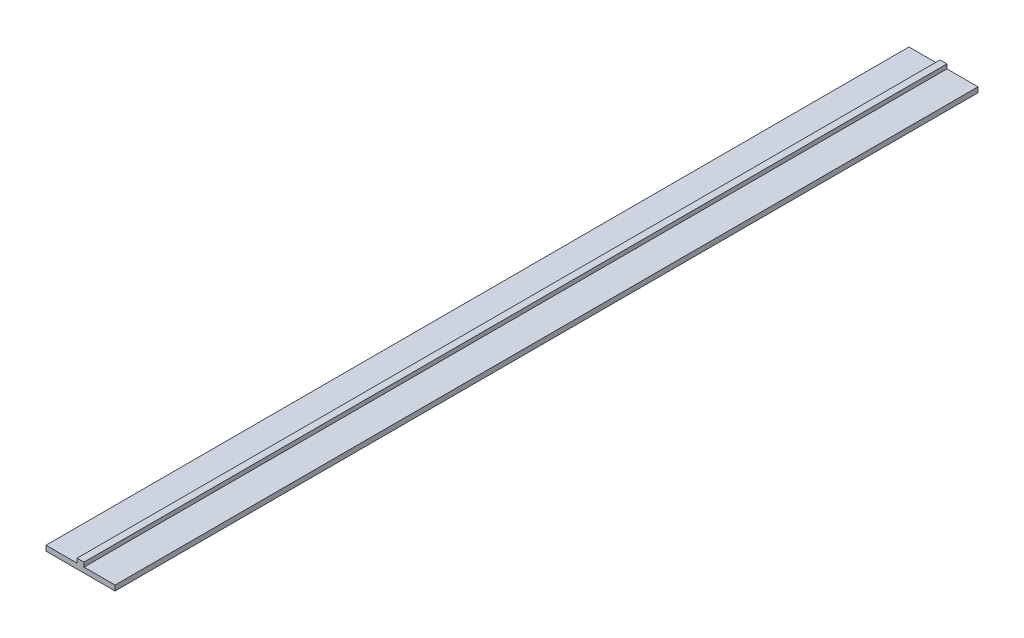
ISO-10303-21;
HEADER;
FILE_DESCRIPTION(('STEP AP214'),'2;1');
FILE_NAME('part.step','',(''),(''),'','','');
FILE_SCHEMA(('AUTOMOTIVE_DESIGN { 1 0 10303 214 1 1 1 1 }'));
ENDSEC;
DATA;
#1=APPLICATION_CONTEXT('core data for automotive mechanical design processes');
#2=APPLICATION_PROTOCOL_DEFINITION('international standard','automotive_design',2000,#1);
#3=PRODUCT_CONTEXT('',#1,'mechanical');
#4=PRODUCT('Part','Part','',(#3));
#5=PRODUCT_RELATED_PRODUCT_CATEGORY('part','',(#4));
#6=PRODUCT_DEFINITION_FORMATION('','',#4);
#7=PRODUCT_DEFINITION_CONTEXT('part definition',#1,'design');
#8=PRODUCT_DEFINITION('design','',#6,#7);
#9=PRODUCT_DEFINITION_SHAPE('','',#8);
#10=(LENGTH_UNIT() NAMED_UNIT(*) SI_UNIT(.MILLI.,.METRE.));
#11=(NAMED_UNIT(*) PLANE_ANGLE_UNIT() SI_UNIT($,.RADIAN.));
#12=(NAMED_UNIT(*) SI_UNIT($,.STERADIAN.) SOLID_ANGLE_UNIT());
#13=UNCERTAINTY_MEASURE_WITH_UNIT(LENGTH_MEASURE(1.E-05),#10,'distance_accuracy_value','');
#14=(GEOMETRIC_REPRESENTATION_CONTEXT(3) GLOBAL_UNCERTAINTY_ASSIGNED_CONTEXT((#13)) GLOBAL_UNIT_ASSIGNED_CONTEXT((#10,
#11,#12)) REPRESENTATION_CONTEXT('',''));
#15=CARTESIAN_POINT('',(0.,0.,0.));
#16=DIRECTION('',(0.,0.,1.));
#17=DIRECTION('',(1.,0.,0.));
#18=AXIS2_PLACEMENT_3D('',#15,#16,#17);
#19=CARTESIAN_POINT('',(-20.,3.,500.));
#20=DIRECTION('',(1.,0.,0.));
#21=DIRECTION('',(0.,0.,-1.));
#22=AXIS2_PLACEMENT_3D('',#19,#20,#21);
#23=PLANE('',#22);
#24=DIRECTION('',(0.,-1.,0.));
#25=VECTOR('',#24,1.);
#26=CARTESIAN_POINT('',(-20.,3.,0.));
#27=LINE('',#26,#25);
#28=CARTESIAN_POINT('',(-20.,3.,0.));
#29=VERTEX_POINT('',#28);
#30=CARTESIAN_POINT('',(-20.,0.,0.));
#31=VERTEX_POINT('',#30);
#32=EDGE_CURVE('E110',#29,#31,#27,.T.);
#33=ORIENTED_EDGE('',*,*,#32,.T.);
#34=DIRECTION('',(0.,0.,-1.));
#35=VECTOR('',#34,1.);
#36=CARTESIAN_POINT('',(-20.,0.,500.));
#37=LINE('',#36,#35);
#38=CARTESIAN_POINT('',(-20.,0.,500.));
#39=VERTEX_POINT('',#38);
#40=EDGE_CURVE('E9',#39,#31,#37,.T.);
#41=ORIENTED_EDGE('',*,*,#40,.F.);
#42=DIRECTION('',(0.,-1.,0.));
#43=VECTOR('',#42,1.);
#44=CARTESIAN_POINT('',(-20.,3.,500.));
#45=LINE('',#44,#43);
#46=CARTESIAN_POINT('',(-20.,3.,500.));
#47=VERTEX_POINT('',#46);
#48=EDGE_CURVE('E124',#47,#39,#45,.T.);
#49=ORIENTED_EDGE('',*,*,#48,.F.);
#50=DIRECTION('',(0.,0.,-1.));
#51=VECTOR('',#50,1.);
#52=CARTESIAN_POINT('',(-20.,3.,500.));
#53=LINE('',#52,#51);
#54=EDGE_CURVE('E106',#47,#29,#53,.T.);
#55=ORIENTED_EDGE('',*,*,#54,.T.);
#56=EDGE_LOOP('',(#33,#41,#49,#55));
#57=FACE_BOUND('',#56,.T.);
#58=ADVANCED_FACE('F14',(#57),#23,.F.);
#59=CARTESIAN_POINT('',(-20.,0.,500.));
#60=DIRECTION('',(0.,1.,0.));
#61=DIRECTION('',(0.,0.,1.));
#62=AXIS2_PLACEMENT_3D('',#59,#60,#61);
#63=PLANE('',#62);
#64=DIRECTION('',(1.,0.,0.));
#65=VECTOR('',#64,1.);
#66=CARTESIAN_POINT('',(-20.,0.,0.));
#67=LINE('',#66,#65);
#68=CARTESIAN_POINT('',(20.,0.,0.));
#69=VERTEX_POINT('',#68);
#70=EDGE_CURVE('E113',#31,#69,#67,.T.);
#71=ORIENTED_EDGE('',*,*,#70,.T.);
#72=DIRECTION('',(0.,0.,-1.));
#73=VECTOR('',#72,1.);
#74=CARTESIAN_POINT('',(20.,0.,500.));
#75=LINE('',#74,#73);
#76=CARTESIAN_POINT('',(20.,0.,500.));
#77=VERTEX_POINT('',#76);
#78=EDGE_CURVE('E22',#77,#69,#75,.T.);
#79=ORIENTED_EDGE('',*,*,#78,.F.);
#80=DIRECTION('',(1.,0.,0.));
#81=VECTOR('',#80,1.);
#82=CARTESIAN_POINT('',(-20.,0.,500.));
#83=LINE('',#82,#81);
#84=EDGE_CURVE('E73',#39,#77,#83,.T.);
#85=ORIENTED_EDGE('',*,*,#84,.F.);
#86=ORIENTED_EDGE('',*,*,#40,.T.);
#87=EDGE_LOOP('',(#71,#79,#85,#86));
#88=FACE_BOUND('',#87,.T.);
#89=ADVANCED_FACE('F159',(#88),#63,.F.);
#90=CARTESIAN_POINT('',(20.,3.,500.));
#91=DIRECTION('',(-1.,0.,0.));
#92=DIRECTION('',(0.,0.,1.));
#93=AXIS2_PLACEMENT_3D('',#90,#91,#92);
#94=PLANE('',#93);
#95=DIRECTION('',(0.,1.,0.));
#96=VECTOR('',#95,1.);
#97=CARTESIAN_POINT('',(20.,3.,0.));
#98=LINE('',#97,#96);
#99=CARTESIAN_POINT('',(20.,3.,0.));
#100=VERTEX_POINT('',#99);
#101=EDGE_CURVE('E115',#69,#100,#98,.T.);
#102=ORIENTED_EDGE('',*,*,#101,.T.);
#103=DIRECTION('',(0.,0.,-1.));
#104=VECTOR('',#103,1.);
#105=CARTESIAN_POINT('',(20.,3.,500.));
#106=LINE('',#105,#104);
#107=CARTESIAN_POINT('',(20.,3.,500.));
#108=VERTEX_POINT('',#107);
#109=EDGE_CURVE('E131',#108,#100,#106,.T.);
#110=ORIENTED_EDGE('',*,*,#109,.F.);
#111=DIRECTION('',(0.,1.,0.));
#112=VECTOR('',#111,1.);
#113=CARTESIAN_POINT('',(20.,3.,500.));
#114=LINE('',#113,#112);
#115=EDGE_CURVE('E139',#77,#108,#114,.T.);
#116=ORIENTED_EDGE('',*,*,#115,.F.);
#117=ORIENTED_EDGE('',*,*,#78,.T.);
#118=EDGE_LOOP('',(#102,#110,#116,#117));
#119=FACE_BOUND('',#118,.T.);
#120=ADVANCED_FACE('F137',(#119),#94,.F.);
#121=CARTESIAN_POINT('',(20.,3.,500.));
#122=DIRECTION('',(0.,-1.,0.));
#123=DIRECTION('',(0.,0.,-1.));
#124=AXIS2_PLACEMENT_3D('',#121,#122,#123);
#125=PLANE('',#124);
#126=DIRECTION('',(-1.,0.,0.));
#127=VECTOR('',#126,1.);
#128=CARTESIAN_POINT('',(20.,3.,0.));
#129=LINE('',#128,#127);
#130=CARTESIAN_POINT('',(2.00000000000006,3.,0.));
#131=VERTEX_POINT('',#130);
#132=EDGE_CURVE('E117',#100,#131,#129,.T.);
#133=ORIENTED_EDGE('',*,*,#132,.T.);
#134=DIRECTION('',(0.,0.,-1.));
#135=VECTOR('',#134,1.);
#136=CARTESIAN_POINT('',(2.00000000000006,3.,500.));
#137=LINE('',#136,#135);
#138=CARTESIAN_POINT('',(2.00000000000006,3.,500.));
#139=VERTEX_POINT('',#138);
#140=EDGE_CURVE('E128',#139,#131,#137,.T.);
#141=ORIENTED_EDGE('',*,*,#140,.F.);
#142=DIRECTION('',(-1.,0.,0.));
#143=VECTOR('',#142,1.);
#144=CARTESIAN_POINT('',(20.,3.,500.));
#145=LINE('',#144,#143);
#146=EDGE_CURVE('E151',#108,#139,#145,.T.);
#147=ORIENTED_EDGE('',*,*,#146,.F.);
#148=ORIENTED_EDGE('',*,*,#109,.T.);
#149=EDGE_LOOP('',(#133,#141,#147,#148));
#150=FACE_BOUND('',#149,.T.);
#151=ADVANCED_FACE('F147',(#150),#125,.F.);
#152=CARTESIAN_POINT('',(2.00000000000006,5.5,500.));
#153=DIRECTION('',(-1.,0.,0.));
#154=DIRECTION('',(0.,0.,1.));
#155=AXIS2_PLACEMENT_3D('',#152,#153,#154);
#156=PLANE('',#155);
#157=DIRECTION('',(0.,1.,0.));
#158=VECTOR('',#157,1.);
#159=CARTESIAN_POINT('',(2.00000000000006,5.5,0.));
#160=LINE('',#159,#158);
#161=CARTESIAN_POINT('',(2.00000000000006,5.5,0.));
#162=VERTEX_POINT('',#161);
#163=EDGE_CURVE('E119',#131,#162,#160,.T.);
#164=ORIENTED_EDGE('',*,*,#163,.T.);
#165=DIRECTION('',(0.,0.,-1.));
#166=VECTOR('',#165,1.);
#167=CARTESIAN_POINT('',(2.00000000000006,5.5,500.));
#168=LINE('',#167,#166);
#169=CARTESIAN_POINT('',(2.00000000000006,5.5,500.));
#170=VERTEX_POINT('',#169);
#171=EDGE_CURVE('E101',#170,#162,#168,.T.);
#172=ORIENTED_EDGE('',*,*,#171,.F.);
#173=DIRECTION('',(0.,1.,0.));
#174=VECTOR('',#173,1.);
#175=CARTESIAN_POINT('',(2.00000000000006,5.5,500.));
#176=LINE('',#175,#174);
#177=EDGE_CURVE('E92',#139,#170,#176,.T.);
#178=ORIENTED_EDGE('',*,*,#177,.F.);
#179=ORIENTED_EDGE('',*,*,#140,.T.);
#180=EDGE_LOOP('',(#164,#172,#178,#179));
#181=FACE_BOUND('',#180,.T.);
#182=ADVANCED_FACE('F150',(#181),#156,.F.);
#183=CARTESIAN_POINT('',(-2.00000000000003,5.5,500.));
#184=DIRECTION('',(0.,-1.,0.));
#185=DIRECTION('',(0.,0.,-1.));
#186=AXIS2_PLACEMENT_3D('',#183,#184,#185);
#187=PLANE('',#186);
#188=DIRECTION('',(-1.,0.,0.));
#189=VECTOR('',#188,1.);
#190=CARTESIAN_POINT('',(-2.00000000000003,5.5,0.));
#191=LINE('',#190,#189);
#192=CARTESIAN_POINT('',(-2.00000000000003,5.5,0.));
#193=VERTEX_POINT('',#192);
#194=EDGE_CURVE('E100',#162,#193,#191,.T.);
#195=ORIENTED_EDGE('',*,*,#194,.T.);
#196=DIRECTION('',(0.,0.,-1.));
#197=VECTOR('',#196,1.);
#198=CARTESIAN_POINT('',(-2.00000000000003,5.5,500.));
#199=LINE('',#198,#197);
#200=CARTESIAN_POINT('',(-2.00000000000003,5.5,500.));
#201=VERTEX_POINT('',#200);
#202=EDGE_CURVE('E97',#201,#193,#199,.T.);
#203=ORIENTED_EDGE('',*,*,#202,.F.);
#204=DIRECTION('',(-1.,0.,0.));
#205=VECTOR('',#204,1.);
#206=CARTESIAN_POINT('',(-2.00000000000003,5.5,500.));
#207=LINE('',#206,#205);
#208=EDGE_CURVE('E86',#170,#201,#207,.T.);
#209=ORIENTED_EDGE('',*,*,#208,.F.);
#210=ORIENTED_EDGE('',*,*,#171,.T.);
#211=EDGE_LOOP('',(#195,#203,#209,#210));
#212=FACE_BOUND('',#211,.T.);
#213=ADVANCED_FACE('F98',(#212),#187,.F.);
#214=CARTESIAN_POINT('',(-2.00000000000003,5.5,500.));
#215=DIRECTION('',(1.,0.,0.));
#216=DIRECTION('',(0.,0.,-1.));
#217=AXIS2_PLACEMENT_3D('',#214,#215,#216);
#218=PLANE('',#217);
#219=DIRECTION('',(0.,-1.,0.));
#220=VECTOR('',#219,1.);
#221=CARTESIAN_POINT('',(-2.00000000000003,5.5,0.));
#222=LINE('',#221,#220);
#223=CARTESIAN_POINT('',(-2.00000000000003,3.,0.));
#224=VERTEX_POINT('',#223);
#225=EDGE_CURVE('E59',#193,#224,#222,.T.);
#226=ORIENTED_EDGE('',*,*,#225,.T.);
#227=DIRECTION('',(0.,0.,-1.));
#228=VECTOR('',#227,1.);
#229=CARTESIAN_POINT('',(-2.00000000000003,3.,500.));
#230=LINE('',#229,#228);
#231=CARTESIAN_POINT('',(-2.00000000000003,3.,500.));
#232=VERTEX_POINT('',#231);
#233=EDGE_CURVE('E102',#232,#224,#230,.T.);
#234=ORIENTED_EDGE('',*,*,#233,.F.);
#235=DIRECTION('',(0.,-1.,0.));
#236=VECTOR('',#235,1.);
#237=CARTESIAN_POINT('',(-2.00000000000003,5.5,500.));
#238=LINE('',#237,#236);
#239=EDGE_CURVE('E90',#201,#232,#238,.T.);
#240=ORIENTED_EDGE('',*,*,#239,.F.);
#241=ORIENTED_EDGE('',*,*,#202,.T.);
#242=EDGE_LOOP('',(#226,#234,#240,#241));
#243=FACE_BOUND('',#242,.T.);
#244=ADVANCED_FACE('F104',(#243),#218,.F.);
#245=CARTESIAN_POINT('',(-20.,3.,500.));
#246=DIRECTION('',(0.,-1.,0.));
#247=DIRECTION('',(0.,0.,-1.));
#248=AXIS2_PLACEMENT_3D('',#245,#246,#247);
#249=PLANE('',#248);
#250=DIRECTION('',(-1.,0.,0.));
#251=VECTOR('',#250,1.);
#252=CARTESIAN_POINT('',(-20.,3.,0.));
#253=LINE('',#252,#251);
#254=EDGE_CURVE('E65',#224,#29,#253,.T.);
#255=ORIENTED_EDGE('',*,*,#254,.T.);
#256=ORIENTED_EDGE('',*,*,#54,.F.);
#257=DIRECTION('',(-1.,0.,0.));
#258=VECTOR('',#257,1.);
#259=CARTESIAN_POINT('',(-20.,3.,500.));
#260=LINE('',#259,#258);
#261=EDGE_CURVE('E30',#232,#47,#260,.T.);
#262=ORIENTED_EDGE('',*,*,#261,.F.);
#263=ORIENTED_EDGE('',*,*,#233,.T.);
#264=EDGE_LOOP('',(#255,#256,#262,#263));
#265=FACE_BOUND('',#264,.T.);
#266=ADVANCED_FACE('F177',(#265),#249,.F.);
#267=CARTESIAN_POINT('',(-20.,0.,500.));
#268=DIRECTION('',(0.,0.,1.));
#269=DIRECTION('',(1.,0.,0.));
#270=AXIS2_PLACEMENT_3D('',#267,#268,#269);
#271=PLANE('',#270);
#272=ORIENTED_EDGE('',*,*,#48,.T.);
#273=ORIENTED_EDGE('',*,*,#84,.T.);
#274=ORIENTED_EDGE('',*,*,#115,.T.);
#275=ORIENTED_EDGE('',*,*,#146,.T.);
#276=ORIENTED_EDGE('',*,*,#177,.T.);
#277=ORIENTED_EDGE('',*,*,#208,.T.);
#278=ORIENTED_EDGE('',*,*,#239,.T.);
#279=ORIENTED_EDGE('',*,*,#261,.T.);
#280=EDGE_LOOP('',(#272,#273,#274,#275,#276,#277,#278,#279));
#281=FACE_BOUND('',#280,.T.);
#282=ADVANCED_FACE('F88',(#281),#271,.T.);
#283=CARTESIAN_POINT('',(-20.,0.,0.));
#284=DIRECTION('',(0.,0.,1.));
#285=DIRECTION('',(1.,0.,0.));
#286=AXIS2_PLACEMENT_3D('',#283,#284,#285);
#287=PLANE('',#286);
#288=ORIENTED_EDGE('',*,*,#32,.F.);
#289=ORIENTED_EDGE('',*,*,#254,.F.);
#290=ORIENTED_EDGE('',*,*,#225,.F.);
#291=ORIENTED_EDGE('',*,*,#194,.F.);
#292=ORIENTED_EDGE('',*,*,#163,.F.);
#293=ORIENTED_EDGE('',*,*,#132,.F.);
#294=ORIENTED_EDGE('',*,*,#101,.F.);
#295=ORIENTED_EDGE('',*,*,#70,.F.);
#296=EDGE_LOOP('',(#288,#289,#290,#291,#292,#293,#294,#295));
#297=FACE_BOUND('',#296,.T.);
#298=ADVANCED_FACE('F143',(#297),#287,.F.);
#299=CLOSED_SHELL('',(#58,#89,#120,#151,#182,#213,#244,#266,#282,#298));
#300=MANIFOLD_SOLID_BREP('B1',#299);
#301=ADVANCED_BREP_SHAPE_REPRESENTATION('',(#18,#300),#14);
#302=SHAPE_DEFINITION_REPRESENTATION(#9,#301);
ENDSEC;
END-ISO-10303-21;
